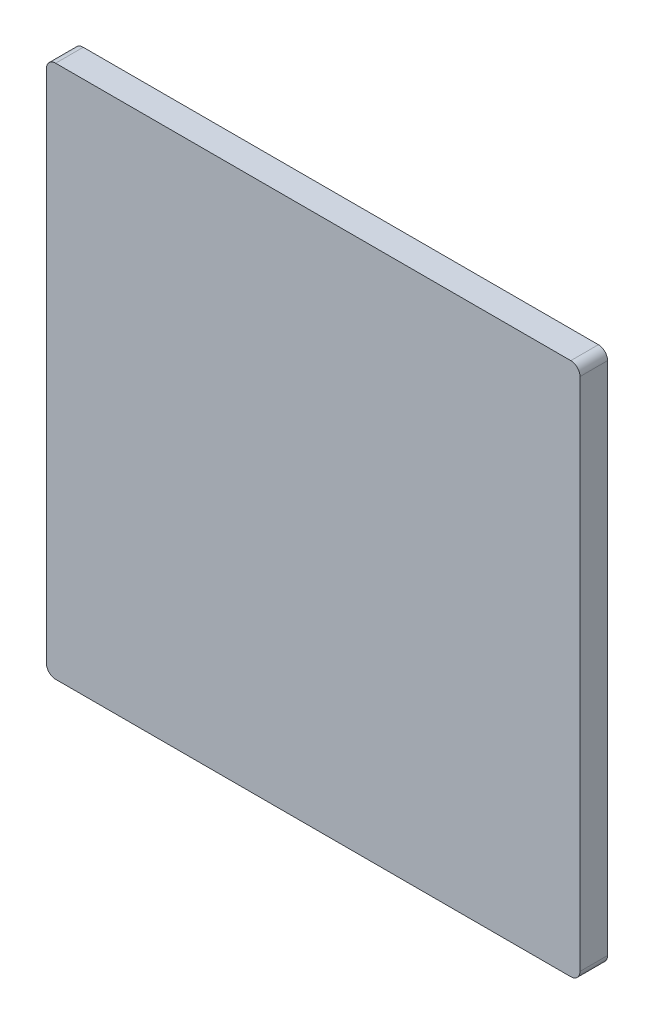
ISO-10303-21;
HEADER;
FILE_DESCRIPTION(('STEP AP214'),'2;1');
FILE_NAME('part.step','',(''),(''),'','','');
FILE_SCHEMA(('AUTOMOTIVE_DESIGN { 1 0 10303 214 1 1 1 1 }'));
ENDSEC;
DATA;
#1=APPLICATION_CONTEXT('core data for automotive mechanical design processes');
#2=APPLICATION_PROTOCOL_DEFINITION('international standard','automotive_design',2000,#1);
#3=PRODUCT_CONTEXT('',#1,'mechanical');
#4=PRODUCT('Part','Part','',(#3));
#5=PRODUCT_RELATED_PRODUCT_CATEGORY('part','',(#4));
#6=PRODUCT_DEFINITION_FORMATION('','',#4);
#7=PRODUCT_DEFINITION_CONTEXT('part definition',#1,'design');
#8=PRODUCT_DEFINITION('design','',#6,#7);
#9=PRODUCT_DEFINITION_SHAPE('','',#8);
#10=(LENGTH_UNIT() NAMED_UNIT(*) SI_UNIT(.MILLI.,.METRE.));
#11=(NAMED_UNIT(*) PLANE_ANGLE_UNIT() SI_UNIT($,.RADIAN.));
#12=(NAMED_UNIT(*) SI_UNIT($,.STERADIAN.) SOLID_ANGLE_UNIT());
#13=UNCERTAINTY_MEASURE_WITH_UNIT(LENGTH_MEASURE(1.E-05),#10,'distance_accuracy_value','');
#14=(GEOMETRIC_REPRESENTATION_CONTEXT(3) GLOBAL_UNCERTAINTY_ASSIGNED_CONTEXT((#13)) GLOBAL_UNIT_ASSIGNED_CONTEXT((#10,
#11,#12)) REPRESENTATION_CONTEXT('',''));
#15=CARTESIAN_POINT('',(0.,0.,0.));
#16=DIRECTION('',(0.,0.,1.));
#17=DIRECTION('',(1.,0.,0.));
#18=AXIS2_PLACEMENT_3D('',#15,#16,#17);
#19=CARTESIAN_POINT('',(-44.4499999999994,44.4499999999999,4.7625));
#20=DIRECTION('',(0.,0.,-1.));
#21=DIRECTION('',(-1.,0.,0.));
#22=AXIS2_PLACEMENT_3D('',#19,#20,#21);
#23=CYLINDRICAL_SURFACE('',#22,1.5875);
#24=CARTESIAN_POINT('',(-44.4499999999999,44.4499999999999,0.));
#25=DIRECTION('',(0.,0.,1.));
#26=DIRECTION('',(-1.,0.,0.));
#27=AXIS2_PLACEMENT_3D('',#24,#25,#26);
#28=CIRCLE('',#27,1.5875);
#29=CARTESIAN_POINT('',(-44.4499999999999,46.0374999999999,0.));
#30=VERTEX_POINT('',#29);
#31=CARTESIAN_POINT('',(-46.0375,44.4499999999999,0.));
#32=VERTEX_POINT('',#31);
#33=EDGE_CURVE('E135',#30,#32,#28,.T.);
#34=ORIENTED_EDGE('',*,*,#33,.T.);
#35=DIRECTION('',(0.,0.,-1.));
#36=VECTOR('',#35,1.);
#37=CARTESIAN_POINT('',(-46.0374999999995,44.4499999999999,4.7625));
#38=LINE('',#37,#36);
#39=CARTESIAN_POINT('',(-46.0374999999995,44.4499999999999,4.7625));
#40=VERTEX_POINT('',#39);
#41=EDGE_CURVE('E11',#40,#32,#38,.T.);
#42=ORIENTED_EDGE('',*,*,#41,.F.);
#43=CARTESIAN_POINT('',(-44.4499999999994,44.4499999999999,4.7625));
#44=DIRECTION('',(0.,0.,1.));
#45=DIRECTION('',(-1.,0.,0.));
#46=AXIS2_PLACEMENT_3D('',#43,#44,#45);
#47=CIRCLE('',#46,1.5875);
#48=CARTESIAN_POINT('',(-44.4499999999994,46.0374999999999,4.7625));
#49=VERTEX_POINT('',#48);
#50=EDGE_CURVE('E152',#49,#40,#47,.T.);
#51=ORIENTED_EDGE('',*,*,#50,.F.);
#52=DIRECTION('',(0.,0.,-1.));
#53=VECTOR('',#52,1.);
#54=CARTESIAN_POINT('',(-44.4499999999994,46.0374999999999,4.7625));
#55=LINE('',#54,#53);
#56=EDGE_CURVE('E131',#49,#30,#55,.T.);
#57=ORIENTED_EDGE('',*,*,#56,.T.);
#58=EDGE_LOOP('',(#34,#42,#51,#57));
#59=FACE_BOUND('',#58,.T.);
#60=ADVANCED_FACE('F38',(#59),#23,.T.);
#61=CARTESIAN_POINT('',(-46.0374999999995,44.4499999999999,4.7625));
#62=DIRECTION('',(1.,0.,0.));
#63=DIRECTION('',(0.,1.,0.));
#64=AXIS2_PLACEMENT_3D('',#61,#62,#63);
#65=PLANE('',#64);
#66=DIRECTION('',(0.,-1.,0.));
#67=VECTOR('',#66,1.);
#68=CARTESIAN_POINT('',(-46.0375,44.4499999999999,0.));
#69=LINE('',#68,#67);
#70=CARTESIAN_POINT('',(-46.0375,-44.4499999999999,0.));
#71=VERTEX_POINT('',#70);
#72=EDGE_CURVE('E138',#32,#71,#69,.T.);
#73=ORIENTED_EDGE('',*,*,#72,.T.);
#74=DIRECTION('',(0.,0.,-1.));
#75=VECTOR('',#74,1.);
#76=CARTESIAN_POINT('',(-46.0375,-44.4499999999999,4.7625));
#77=LINE('',#76,#75);
#78=CARTESIAN_POINT('',(-46.0375,-44.4499999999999,4.7625));
#79=VERTEX_POINT('',#78);
#80=EDGE_CURVE('E46',#79,#71,#77,.T.);
#81=ORIENTED_EDGE('',*,*,#80,.F.);
#82=DIRECTION('',(0.,-1.,0.));
#83=VECTOR('',#82,1.);
#84=CARTESIAN_POINT('',(-46.0374999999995,44.4499999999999,4.7625));
#85=LINE('',#84,#83);
#86=EDGE_CURVE('E97',#40,#79,#85,.T.);
#87=ORIENTED_EDGE('',*,*,#86,.F.);
#88=ORIENTED_EDGE('',*,*,#41,.T.);
#89=EDGE_LOOP('',(#73,#81,#87,#88));
#90=FACE_BOUND('',#89,.T.);
#91=ADVANCED_FACE('F189',(#90),#65,.F.);
#92=CARTESIAN_POINT('',(-44.4499999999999,-44.4499999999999,4.7624999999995));
#93=DIRECTION('',(0.,0.,-1.));
#94=DIRECTION('',(-1.,0.,0.));
#95=AXIS2_PLACEMENT_3D('',#92,#93,#94);
#96=CYLINDRICAL_SURFACE('',#95,1.5875);
#97=CARTESIAN_POINT('',(-44.45,-44.4499999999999,-4.9960036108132E-13));
#98=DIRECTION('',(0.,0.,1.));
#99=DIRECTION('',(1.,0.,0.));
#100=AXIS2_PLACEMENT_3D('',#97,#98,#99);
#101=CIRCLE('',#100,1.5875);
#102=CARTESIAN_POINT('',(-44.45,-46.0374999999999,2.38697950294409E-12));
#103=VERTEX_POINT('',#102);
#104=EDGE_CURVE('E141',#71,#103,#101,.T.);
#105=ORIENTED_EDGE('',*,*,#104,.T.);
#106=DIRECTION('',(0.,0.,-1.));
#107=VECTOR('',#106,1.);
#108=CARTESIAN_POINT('',(-44.4499999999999,-46.0374999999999,4.76250000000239));
#109=LINE('',#108,#107);
#110=CARTESIAN_POINT('',(-44.4499999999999,-46.0374999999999,4.76250000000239));
#111=VERTEX_POINT('',#110);
#112=EDGE_CURVE('E159',#111,#103,#109,.T.);
#113=ORIENTED_EDGE('',*,*,#112,.F.);
#114=CARTESIAN_POINT('',(-44.4499999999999,-44.4499999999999,4.7624999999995));
#115=DIRECTION('',(0.,0.,1.));
#116=DIRECTION('',(1.,0.,0.));
#117=AXIS2_PLACEMENT_3D('',#114,#115,#116);
#118=CIRCLE('',#117,1.5875);
#119=EDGE_CURVE('E167',#79,#111,#118,.T.);
#120=ORIENTED_EDGE('',*,*,#119,.F.);
#121=ORIENTED_EDGE('',*,*,#80,.T.);
#122=EDGE_LOOP('',(#105,#113,#120,#121));
#123=FACE_BOUND('',#122,.T.);
#124=ADVANCED_FACE('F165',(#123),#96,.T.);
#125=CARTESIAN_POINT('',(-44.4499999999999,-46.0374999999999,4.76250000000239));
#126=DIRECTION('',(0.,1.,0.));
#127=DIRECTION('',(-1.,0.,0.));
#128=AXIS2_PLACEMENT_3D('',#125,#126,#127);
#129=PLANE('',#128);
#130=DIRECTION('',(1.,0.,0.));
#131=VECTOR('',#130,1.);
#132=CARTESIAN_POINT('',(-44.45,-46.0374999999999,2.38697950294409E-12));
#133=LINE('',#132,#131);
#134=CARTESIAN_POINT('',(44.45,-46.0375,2.38697950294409E-12));
#135=VERTEX_POINT('',#134);
#136=EDGE_CURVE('E143',#103,#135,#133,.T.);
#137=ORIENTED_EDGE('',*,*,#136,.T.);
#138=DIRECTION('',(0.,0.,-1.));
#139=VECTOR('',#138,1.);
#140=CARTESIAN_POINT('',(44.4500000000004,-46.0375,4.76250000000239));
#141=LINE('',#140,#139);
#142=CARTESIAN_POINT('',(44.4500000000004,-46.0375,4.76250000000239));
#143=VERTEX_POINT('',#142);
#144=EDGE_CURVE('E156',#143,#135,#141,.T.);
#145=ORIENTED_EDGE('',*,*,#144,.F.);
#146=DIRECTION('',(1.,0.,0.));
#147=VECTOR('',#146,1.);
#148=CARTESIAN_POINT('',(-44.4499999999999,-46.0374999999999,4.76250000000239));
#149=LINE('',#148,#147);
#150=EDGE_CURVE('E179',#111,#143,#149,.T.);
#151=ORIENTED_EDGE('',*,*,#150,.F.);
#152=ORIENTED_EDGE('',*,*,#112,.T.);
#153=EDGE_LOOP('',(#137,#145,#151,#152));
#154=FACE_BOUND('',#153,.T.);
#155=ADVANCED_FACE('F175',(#154),#129,.F.);
#156=CARTESIAN_POINT('',(44.4500000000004,-44.4499999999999,4.7624999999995));
#157=DIRECTION('',(0.,0.,-1.));
#158=DIRECTION('',(-1.,0.,0.));
#159=AXIS2_PLACEMENT_3D('',#156,#157,#158);
#160=CYLINDRICAL_SURFACE('',#159,1.5875);
#161=CARTESIAN_POINT('',(44.45,-44.4499999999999,-4.9960036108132E-13));
#162=DIRECTION('',(0.,0.,1.));
#163=DIRECTION('',(1.,0.,0.));
#164=AXIS2_PLACEMENT_3D('',#161,#162,#163);
#165=CIRCLE('',#164,1.5875);
#166=CARTESIAN_POINT('',(46.0375000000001,-44.4499999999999,0.));
#167=VERTEX_POINT('',#166);
#168=EDGE_CURVE('E146',#135,#167,#165,.T.);
#169=ORIENTED_EDGE('',*,*,#168,.T.);
#170=DIRECTION('',(0.,0.,-1.));
#171=VECTOR('',#170,1.);
#172=CARTESIAN_POINT('',(46.0375000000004,-44.4499999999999,4.7625));
#173=LINE('',#172,#171);
#174=CARTESIAN_POINT('',(46.0375000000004,-44.4499999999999,4.7625));
#175=VERTEX_POINT('',#174);
#176=EDGE_CURVE('E126',#175,#167,#173,.T.);
#177=ORIENTED_EDGE('',*,*,#176,.F.);
#178=CARTESIAN_POINT('',(44.4500000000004,-44.4499999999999,4.7624999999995));
#179=DIRECTION('',(0.,0.,1.));
#180=DIRECTION('',(1.,0.,0.));
#181=AXIS2_PLACEMENT_3D('',#178,#179,#180);
#182=CIRCLE('',#181,1.5875);
#183=EDGE_CURVE('E116',#143,#175,#182,.T.);
#184=ORIENTED_EDGE('',*,*,#183,.F.);
#185=ORIENTED_EDGE('',*,*,#144,.T.);
#186=EDGE_LOOP('',(#169,#177,#184,#185));
#187=FACE_BOUND('',#186,.T.);
#188=ADVANCED_FACE('F178',(#187),#160,.T.);
#189=CARTESIAN_POINT('',(46.0375000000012,44.4500000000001,4.7625));
#190=DIRECTION('',(-1.,0.,0.));
#191=DIRECTION('',(0.,-1.,0.));
#192=AXIS2_PLACEMENT_3D('',#189,#190,#191);
#193=PLANE('',#192);
#194=DIRECTION('',(0.,1.,0.));
#195=VECTOR('',#194,1.);
#196=CARTESIAN_POINT('',(46.0375000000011,44.4500000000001,0.));
#197=LINE('',#196,#195);
#198=CARTESIAN_POINT('',(46.0375000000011,44.4500000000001,0.));
#199=VERTEX_POINT('',#198);
#200=EDGE_CURVE('E125',#167,#199,#197,.T.);
#201=ORIENTED_EDGE('',*,*,#200,.T.);
#202=DIRECTION('',(0.,0.,-1.));
#203=VECTOR('',#202,1.);
#204=CARTESIAN_POINT('',(46.0375000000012,44.4500000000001,4.7625));
#205=LINE('',#204,#203);
#206=CARTESIAN_POINT('',(46.0375000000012,44.4500000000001,4.7625));
#207=VERTEX_POINT('',#206);
#208=EDGE_CURVE('E122',#207,#199,#205,.T.);
#209=ORIENTED_EDGE('',*,*,#208,.F.);
#210=DIRECTION('',(0.,1.,0.));
#211=VECTOR('',#210,1.);
#212=CARTESIAN_POINT('',(46.0375000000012,44.4500000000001,4.7625));
#213=LINE('',#212,#211);
#214=EDGE_CURVE('E110',#175,#207,#213,.T.);
#215=ORIENTED_EDGE('',*,*,#214,.F.);
#216=ORIENTED_EDGE('',*,*,#176,.T.);
#217=EDGE_LOOP('',(#201,#209,#215,#216));
#218=FACE_BOUND('',#217,.T.);
#219=ADVANCED_FACE('F123',(#218),#193,.F.);
#220=CARTESIAN_POINT('',(44.4500000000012,44.4500000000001,4.7625));
#221=DIRECTION('',(0.,0.,-1.));
#222=DIRECTION('',(-1.,0.,0.));
#223=AXIS2_PLACEMENT_3D('',#220,#221,#222);
#224=CYLINDRICAL_SURFACE('',#223,1.5875);
#225=CARTESIAN_POINT('',(44.4500000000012,44.4500000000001,0.));
#226=DIRECTION('',(0.,0.,1.));
#227=DIRECTION('',(1.,0.,0.));
#228=AXIS2_PLACEMENT_3D('',#225,#226,#227);
#229=CIRCLE('',#228,1.5875);
#230=CARTESIAN_POINT('',(44.4500000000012,46.0374999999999,0.));
#231=VERTEX_POINT('',#230);
#232=EDGE_CURVE('E83',#199,#231,#229,.T.);
#233=ORIENTED_EDGE('',*,*,#232,.T.);
#234=DIRECTION('',(0.,0.,-1.));
#235=VECTOR('',#234,1.);
#236=CARTESIAN_POINT('',(44.4500000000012,46.0374999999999,4.7625));
#237=LINE('',#236,#235);
#238=CARTESIAN_POINT('',(44.4500000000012,46.0374999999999,4.7625));
#239=VERTEX_POINT('',#238);
#240=EDGE_CURVE('E127',#239,#231,#237,.T.);
#241=ORIENTED_EDGE('',*,*,#240,.F.);
#242=CARTESIAN_POINT('',(44.4500000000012,44.4500000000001,4.7625));
#243=DIRECTION('',(0.,0.,1.));
#244=DIRECTION('',(1.,0.,0.));
#245=AXIS2_PLACEMENT_3D('',#242,#243,#244);
#246=CIRCLE('',#245,1.5875);
#247=EDGE_CURVE('E114',#207,#239,#246,.T.);
#248=ORIENTED_EDGE('',*,*,#247,.F.);
#249=ORIENTED_EDGE('',*,*,#208,.T.);
#250=EDGE_LOOP('',(#233,#241,#248,#249));
#251=FACE_BOUND('',#250,.T.);
#252=ADVANCED_FACE('F129',(#251),#224,.T.);
#253=CARTESIAN_POINT('',(-44.4499999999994,46.0374999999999,4.7625));
#254=DIRECTION('',(0.,-1.,0.));
#255=DIRECTION('',(1.,0.,0.));
#256=AXIS2_PLACEMENT_3D('',#253,#254,#255);
#257=PLANE('',#256);
#258=DIRECTION('',(-1.,0.,0.));
#259=VECTOR('',#258,1.);
#260=CARTESIAN_POINT('',(-44.4499999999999,46.0374999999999,0.));
#261=LINE('',#260,#259);
#262=EDGE_CURVE('E89',#231,#30,#261,.T.);
#263=ORIENTED_EDGE('',*,*,#262,.T.);
#264=ORIENTED_EDGE('',*,*,#56,.F.);
#265=DIRECTION('',(-1.,0.,0.));
#266=VECTOR('',#265,1.);
#267=CARTESIAN_POINT('',(-44.4499999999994,46.0374999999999,4.7625));
#268=LINE('',#267,#266);
#269=EDGE_CURVE('E54',#239,#49,#268,.T.);
#270=ORIENTED_EDGE('',*,*,#269,.F.);
#271=ORIENTED_EDGE('',*,*,#240,.T.);
#272=EDGE_LOOP('',(#263,#264,#270,#271));
#273=FACE_BOUND('',#272,.T.);
#274=ADVANCED_FACE('F205',(#273),#257,.F.);
#275=CARTESIAN_POINT('',(-44.4499999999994,44.4499999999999,4.7625));
#276=DIRECTION('',(0.,0.,-1.));
#277=DIRECTION('',(-1.,0.,0.));
#278=AXIS2_PLACEMENT_3D('',#275,#276,#277);
#279=PLANE('',#278);
#280=ORIENTED_EDGE('',*,*,#50,.T.);
#281=ORIENTED_EDGE('',*,*,#86,.T.);
#282=ORIENTED_EDGE('',*,*,#119,.T.);
#283=ORIENTED_EDGE('',*,*,#150,.T.);
#284=ORIENTED_EDGE('',*,*,#183,.T.);
#285=ORIENTED_EDGE('',*,*,#214,.T.);
#286=ORIENTED_EDGE('',*,*,#247,.T.);
#287=ORIENTED_EDGE('',*,*,#269,.T.);
#288=EDGE_LOOP('',(#280,#281,#282,#283,#284,#285,#286,#287));
#289=FACE_BOUND('',#288,.T.);
#290=ADVANCED_FACE('F112',(#289),#279,.F.);
#291=CARTESIAN_POINT('',(-44.4499999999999,44.4499999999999,0.));
#292=DIRECTION('',(0.,0.,-1.));
#293=DIRECTION('',(-1.,0.,0.));
#294=AXIS2_PLACEMENT_3D('',#291,#292,#293);
#295=PLANE('',#294);
#296=ORIENTED_EDGE('',*,*,#33,.F.);
#297=ORIENTED_EDGE('',*,*,#262,.F.);
#298=ORIENTED_EDGE('',*,*,#232,.F.);
#299=ORIENTED_EDGE('',*,*,#200,.F.);
#300=ORIENTED_EDGE('',*,*,#168,.F.);
#301=ORIENTED_EDGE('',*,*,#136,.F.);
#302=ORIENTED_EDGE('',*,*,#104,.F.);
#303=ORIENTED_EDGE('',*,*,#72,.F.);
#304=EDGE_LOOP('',(#296,#297,#298,#299,#300,#301,#302,#303));
#305=FACE_BOUND('',#304,.T.);
#306=ADVANCED_FACE('F171',(#305),#295,.T.);
#307=CLOSED_SHELL('',(#60,#91,#124,#155,#188,#219,#252,#274,#290,#306));
#308=MANIFOLD_SOLID_BREP('B2',#307);
#309=ADVANCED_BREP_SHAPE_REPRESENTATION('',(#18,#308),#14);
#310=SHAPE_DEFINITION_REPRESENTATION(#9,#309);
ENDSEC;
END-ISO-10303-21;
